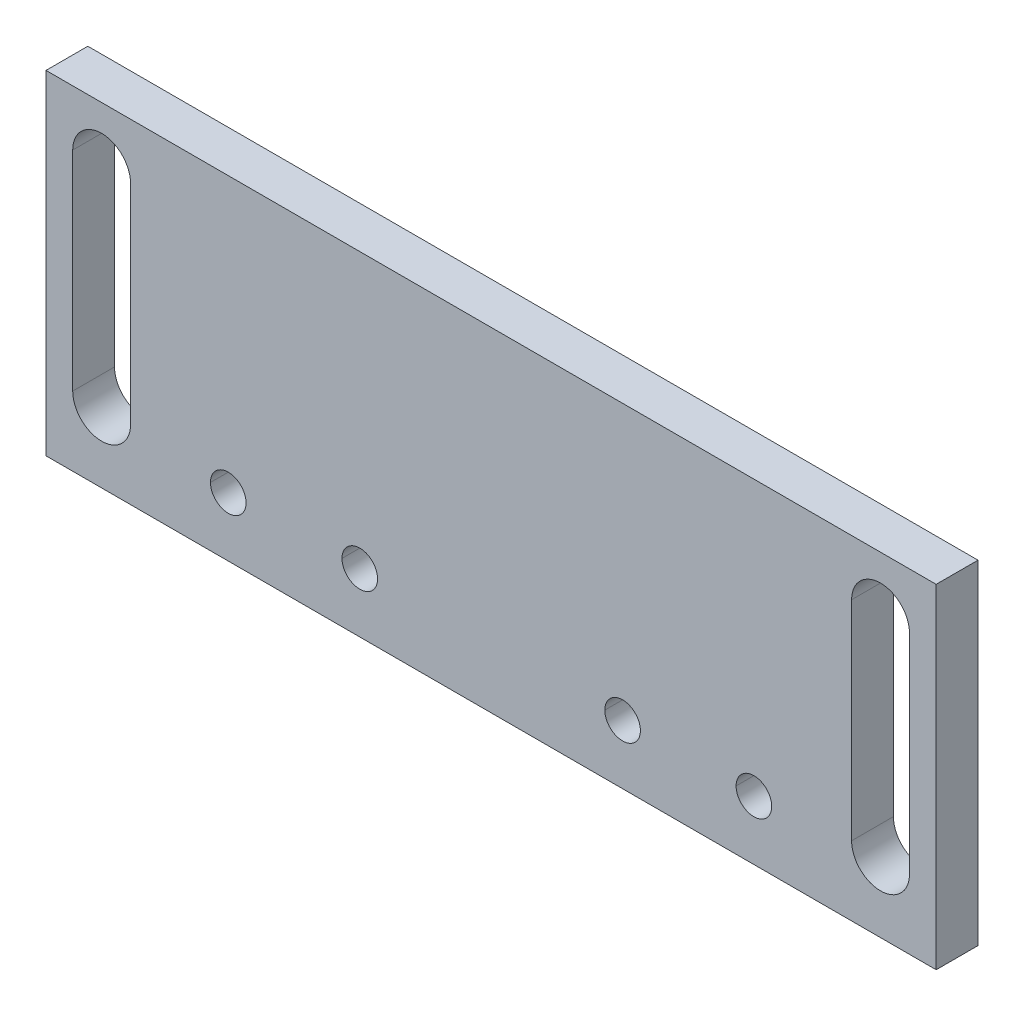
ISO-10303-21;
HEADER;
FILE_DESCRIPTION(('STEP AP214'),'2;1');
FILE_NAME('part.step','',(''),(''),'','','');
FILE_SCHEMA(('AUTOMOTIVE_DESIGN { 1 0 10303 214 1 1 1 1 }'));
ENDSEC;
DATA;
#1=APPLICATION_CONTEXT('core data for automotive mechanical design processes');
#2=APPLICATION_PROTOCOL_DEFINITION('international standard','automotive_design',2000,#1);
#3=PRODUCT_CONTEXT('',#1,'mechanical');
#4=PRODUCT('Part','Part','',(#3));
#5=PRODUCT_RELATED_PRODUCT_CATEGORY('part','',(#4));
#6=PRODUCT_DEFINITION_FORMATION('','',#4);
#7=PRODUCT_DEFINITION_CONTEXT('part definition',#1,'design');
#8=PRODUCT_DEFINITION('design','',#6,#7);
#9=PRODUCT_DEFINITION_SHAPE('','',#8);
#10=(LENGTH_UNIT() NAMED_UNIT(*) SI_UNIT(.MILLI.,.METRE.));
#11=(NAMED_UNIT(*) PLANE_ANGLE_UNIT() SI_UNIT($,.RADIAN.));
#12=(NAMED_UNIT(*) SI_UNIT($,.STERADIAN.) SOLID_ANGLE_UNIT());
#13=UNCERTAINTY_MEASURE_WITH_UNIT(LENGTH_MEASURE(1.E-05),#10,'distance_accuracy_value','');
#14=(GEOMETRIC_REPRESENTATION_CONTEXT(3) GLOBAL_UNCERTAINTY_ASSIGNED_CONTEXT((#13)) GLOBAL_UNIT_ASSIGNED_CONTEXT((#10,
#11,#12)) REPRESENTATION_CONTEXT('',''));
#15=CARTESIAN_POINT('',(0.,0.,0.));
#16=DIRECTION('',(0.,0.,1.));
#17=DIRECTION('',(1.,0.,0.));
#18=AXIS2_PLACEMENT_3D('',#15,#16,#17);
#19=CARTESIAN_POINT('',(69.85,66.5225999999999,4.7752));
#20=DIRECTION('',(0.,0.,-1.));
#21=DIRECTION('',(-1.,0.,0.));
#22=AXIS2_PLACEMENT_3D('',#19,#20,#21);
#23=PLANE('',#22);
#24=DIRECTION('',(1.,0.,0.));
#25=VECTOR('',#24,1.);
#26=CARTESIAN_POINT('',(-31.75,66.5225999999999,4.7752));
#27=LINE('',#26,#25);
#28=CARTESIAN_POINT('',(-31.75,66.5225999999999,4.7752));
#29=VERTEX_POINT('',#28);
#30=CARTESIAN_POINT('',(69.85,66.5225999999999,4.7752));
#31=VERTEX_POINT('',#30);
#32=EDGE_CURVE('E252',#29,#31,#27,.T.);
#33=ORIENTED_EDGE('',*,*,#32,.F.);
#34=DIRECTION('',(0.,1.,0.));
#35=VECTOR('',#34,1.);
#36=CARTESIAN_POINT('',(-31.75,28.4225999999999,4.7752));
#37=LINE('',#36,#35);
#38=CARTESIAN_POINT('',(-31.75,28.4225999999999,4.7752));
#39=VERTEX_POINT('',#38);
#40=EDGE_CURVE('E287',#39,#29,#37,.T.);
#41=ORIENTED_EDGE('',*,*,#40,.F.);
#42=DIRECTION('',(1.,0.,0.));
#43=VECTOR('',#42,1.);
#44=CARTESIAN_POINT('',(69.85,28.4225999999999,4.7752));
#45=LINE('',#44,#43);
#46=CARTESIAN_POINT('',(69.85,28.4225999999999,4.7752));
#47=VERTEX_POINT('',#46);
#48=EDGE_CURVE('E282',#47,#39,#45,.F.);
#49=ORIENTED_EDGE('',*,*,#48,.F.);
#50=DIRECTION('',(0.,1.,0.));
#51=VECTOR('',#50,1.);
#52=CARTESIAN_POINT('',(69.85,66.5225999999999,4.7752));
#53=LINE('',#52,#51);
#54=EDGE_CURVE('E276',#31,#47,#53,.F.);
#55=ORIENTED_EDGE('',*,*,#54,.F.);
#56=EDGE_LOOP('',(#33,#41,#49,#55));
#57=FACE_BOUND('',#56,.T.);
#58=DIRECTION('',(0.,1.,0.));
#59=VECTOR('',#58,1.);
#60=CARTESIAN_POINT('',(-28.702,36.3473999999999,4.7752));
#61=LINE('',#60,#59);
#62=CARTESIAN_POINT('',(-28.702,36.3473999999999,4.7752));
#63=VERTEX_POINT('',#62);
#64=CARTESIAN_POINT('',(-28.702,60.1725999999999,4.7752));
#65=VERTEX_POINT('',#64);
#66=EDGE_CURVE('E250',#63,#65,#61,.T.);
#67=ORIENTED_EDGE('',*,*,#66,.T.);
#68=CARTESIAN_POINT('',(-25.4,60.1725999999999,4.7752));
#69=DIRECTION('',(0.,0.,1.));
#70=DIRECTION('',(1.,0.,0.));
#71=AXIS2_PLACEMENT_3D('',#68,#69,#70);
#72=CIRCLE('',#71,3.302);
#73=CARTESIAN_POINT('',(-22.098,60.1725999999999,4.7752));
#74=VERTEX_POINT('',#73);
#75=EDGE_CURVE('E199',#65,#74,#72,.F.);
#76=ORIENTED_EDGE('',*,*,#75,.T.);
#77=DIRECTION('',(0.,1.,0.));
#78=VECTOR('',#77,1.);
#79=CARTESIAN_POINT('',(-22.098,60.1725999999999,4.7752));
#80=LINE('',#79,#78);
#81=CARTESIAN_POINT('',(-22.098,36.3473999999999,4.7752));
#82=VERTEX_POINT('',#81);
#83=EDGE_CURVE('E247',#74,#82,#80,.F.);
#84=ORIENTED_EDGE('',*,*,#83,.T.);
#85=CARTESIAN_POINT('',(-25.4,36.3473999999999,4.7752));
#86=DIRECTION('',(0.,0.,1.));
#87=DIRECTION('',(1.,0.,0.));
#88=AXIS2_PLACEMENT_3D('',#85,#86,#87);
#89=CIRCLE('',#88,3.302);
#90=EDGE_CURVE('E195',#82,#63,#89,.F.);
#91=ORIENTED_EDGE('',*,*,#90,.T.);
#92=EDGE_LOOP('',(#67,#76,#84,#91));
#93=FACE_BOUND('',#92,.T.);
#94=DIRECTION('',(0.,1.,0.));
#95=VECTOR('',#94,1.);
#96=CARTESIAN_POINT('',(66.802,60.1725999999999,4.7752));
#97=LINE('',#96,#95);
#98=CARTESIAN_POINT('',(66.802,60.1725999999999,4.7752));
#99=VERTEX_POINT('',#98);
#100=CARTESIAN_POINT('',(66.802,36.3473999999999,4.7752));
#101=VERTEX_POINT('',#100);
#102=EDGE_CURVE('E198',#99,#101,#97,.F.);
#103=ORIENTED_EDGE('',*,*,#102,.T.);
#104=CARTESIAN_POINT('',(63.5,36.3473999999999,4.7752));
#105=DIRECTION('',(0.,0.,1.));
#106=DIRECTION('',(1.,0.,0.));
#107=AXIS2_PLACEMENT_3D('',#104,#105,#106);
#108=CIRCLE('',#107,3.302);
#109=CARTESIAN_POINT('',(60.198,36.3473999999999,4.7752));
#110=VERTEX_POINT('',#109);
#111=EDGE_CURVE('E190',#101,#110,#108,.F.);
#112=ORIENTED_EDGE('',*,*,#111,.T.);
#113=DIRECTION('',(0.,1.,0.));
#114=VECTOR('',#113,1.);
#115=CARTESIAN_POINT('',(60.198,36.3473999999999,4.7752));
#116=LINE('',#115,#114);
#117=CARTESIAN_POINT('',(60.198,60.1725999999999,4.7752));
#118=VERTEX_POINT('',#117);
#119=EDGE_CURVE('E241',#110,#118,#116,.T.);
#120=ORIENTED_EDGE('',*,*,#119,.T.);
#121=CARTESIAN_POINT('',(63.5,60.1725999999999,4.7752));
#122=DIRECTION('',(0.,0.,1.));
#123=DIRECTION('',(1.,0.,0.));
#124=AXIS2_PLACEMENT_3D('',#121,#122,#123);
#125=CIRCLE('',#124,3.302);
#126=EDGE_CURVE('E186',#118,#99,#125,.F.);
#127=ORIENTED_EDGE('',*,*,#126,.T.);
#128=EDGE_LOOP('',(#103,#112,#120,#127));
#129=FACE_BOUND('',#128,.T.);
#130=CARTESIAN_POINT('',(4.06399999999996,35.1789999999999,4.7752));
#131=DIRECTION('',(0.,0.,1.));
#132=DIRECTION('',(1.,0.,0.));
#133=AXIS2_PLACEMENT_3D('',#130,#131,#132);
#134=CIRCLE('',#133,2.032);
#135=CARTESIAN_POINT('',(2.03199999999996,35.1789999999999,4.7752));
#136=VERTEX_POINT('',#135);
#137=CARTESIAN_POINT('',(6.09599999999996,35.1789999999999,4.7752));
#138=VERTEX_POINT('',#137);
#139=EDGE_CURVE('E180',#136,#138,#134,.F.);
#140=ORIENTED_EDGE('',*,*,#139,.T.);
#141=CARTESIAN_POINT('',(4.06399999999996,35.1789999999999,4.7752));
#142=DIRECTION('',(0.,0.,1.));
#143=DIRECTION('',(1.,0.,0.));
#144=AXIS2_PLACEMENT_3D('',#141,#142,#143);
#145=CIRCLE('',#144,2.032);
#146=EDGE_CURVE('E182',#138,#136,#145,.F.);
#147=ORIENTED_EDGE('',*,*,#146,.T.);
#148=EDGE_LOOP('',(#140,#147));
#149=FACE_BOUND('',#148,.T.);
#150=CARTESIAN_POINT('',(34.0614,35.1789999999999,4.7752));
#151=DIRECTION('',(0.,0.,1.));
#152=DIRECTION('',(1.,0.,0.));
#153=AXIS2_PLACEMENT_3D('',#150,#151,#152);
#154=CIRCLE('',#153,2.032);
#155=CARTESIAN_POINT('',(32.0294,35.1789999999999,4.7752));
#156=VERTEX_POINT('',#155);
#157=CARTESIAN_POINT('',(36.0934,35.1789999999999,4.7752));
#158=VERTEX_POINT('',#157);
#159=EDGE_CURVE('E174',#156,#158,#154,.F.);
#160=ORIENTED_EDGE('',*,*,#159,.T.);
#161=CARTESIAN_POINT('',(34.0614,35.1789999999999,4.7752));
#162=DIRECTION('',(0.,0.,1.));
#163=DIRECTION('',(1.,0.,0.));
#164=AXIS2_PLACEMENT_3D('',#161,#162,#163);
#165=CIRCLE('',#164,2.032);
#166=EDGE_CURVE('E176',#158,#156,#165,.F.);
#167=ORIENTED_EDGE('',*,*,#166,.T.);
#168=EDGE_LOOP('',(#160,#167));
#169=FACE_BOUND('',#168,.T.);
#170=CARTESIAN_POINT('',(-10.9474,35.1789999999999,4.7752));
#171=DIRECTION('',(0.,0.,1.));
#172=DIRECTION('',(1.,0.,0.));
#173=AXIS2_PLACEMENT_3D('',#170,#171,#172);
#174=CIRCLE('',#173,2.032);
#175=CARTESIAN_POINT('',(-12.9794,35.1789999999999,4.7752));
#176=VERTEX_POINT('',#175);
#177=CARTESIAN_POINT('',(-8.91540000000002,35.1789999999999,4.7752));
#178=VERTEX_POINT('',#177);
#179=EDGE_CURVE('E164',#176,#178,#174,.F.);
#180=ORIENTED_EDGE('',*,*,#179,.T.);
#181=CARTESIAN_POINT('',(-10.9474,35.1789999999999,4.7752));
#182=DIRECTION('',(0.,0.,1.));
#183=DIRECTION('',(1.,0.,0.));
#184=AXIS2_PLACEMENT_3D('',#181,#182,#183);
#185=CIRCLE('',#184,2.032);
#186=EDGE_CURVE('E171',#178,#176,#185,.F.);
#187=ORIENTED_EDGE('',*,*,#186,.T.);
#188=EDGE_LOOP('',(#180,#187));
#189=FACE_BOUND('',#188,.T.);
#190=CARTESIAN_POINT('',(49.0474,35.1789999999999,4.7752));
#191=DIRECTION('',(0.,0.,1.));
#192=DIRECTION('',(1.,0.,0.));
#193=AXIS2_PLACEMENT_3D('',#190,#191,#192);
#194=CIRCLE('',#193,2.032);
#195=CARTESIAN_POINT('',(47.0154,35.1789999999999,4.7752));
#196=VERTEX_POINT('',#195);
#197=CARTESIAN_POINT('',(51.0794,35.1789999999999,4.7752));
#198=VERTEX_POINT('',#197);
#199=EDGE_CURVE('E19',#196,#198,#194,.F.);
#200=ORIENTED_EDGE('',*,*,#199,.T.);
#201=CARTESIAN_POINT('',(49.0474,35.1789999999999,4.7752));
#202=DIRECTION('',(0.,0.,1.));
#203=DIRECTION('',(1.,0.,0.));
#204=AXIS2_PLACEMENT_3D('',#201,#202,#203);
#205=CIRCLE('',#204,2.032);
#206=EDGE_CURVE('E151',#198,#196,#205,.F.);
#207=ORIENTED_EDGE('',*,*,#206,.T.);
#208=EDGE_LOOP('',(#200,#207));
#209=FACE_BOUND('',#208,.T.);
#210=ADVANCED_FACE('F16',(#57,#93,#129,#149,#169,#189,#209),#23,.F.);
#211=CARTESIAN_POINT('',(49.0474,35.1789999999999,0.));
#212=DIRECTION('',(0.,0.,1.));
#213=DIRECTION('',(1.,0.,0.));
#214=AXIS2_PLACEMENT_3D('',#211,#212,#213);
#215=CYLINDRICAL_SURFACE('',#214,2.032);
#216=ORIENTED_EDGE('',*,*,#199,.F.);
#217=DIRECTION('',(0.,0.,1.));
#218=VECTOR('',#217,1.);
#219=CARTESIAN_POINT('',(47.0154,35.1789999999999,0.));
#220=LINE('',#219,#218);
#221=CARTESIAN_POINT('',(47.0154,35.1789999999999,0.));
#222=VERTEX_POINT('',#221);
#223=EDGE_CURVE('E165',#196,#222,#220,.F.);
#224=ORIENTED_EDGE('',*,*,#223,.T.);
#225=CARTESIAN_POINT('',(49.0474,35.1789999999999,0.));
#226=DIRECTION('',(0.,0.,1.));
#227=DIRECTION('',(1.,0.,0.));
#228=AXIS2_PLACEMENT_3D('',#225,#226,#227);
#229=CIRCLE('',#228,2.032);
#230=CARTESIAN_POINT('',(51.0794,35.1789999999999,0.));
#231=VERTEX_POINT('',#230);
#232=EDGE_CURVE('E160',#231,#222,#229,.T.);
#233=ORIENTED_EDGE('',*,*,#232,.F.);
#234=DIRECTION('',(0.,0.,1.));
#235=VECTOR('',#234,1.);
#236=CARTESIAN_POINT('',(51.0794,35.1789999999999,0.));
#237=LINE('',#236,#235);
#238=EDGE_CURVE('E157',#231,#198,#237,.T.);
#239=ORIENTED_EDGE('',*,*,#238,.T.);
#240=EDGE_LOOP('',(#216,#224,#233,#239));
#241=FACE_BOUND('',#240,.T.);
#242=ADVANCED_FACE('F158',(#241),#215,.F.);
#243=CARTESIAN_POINT('',(49.0474,35.1789999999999,0.));
#244=DIRECTION('',(0.,0.,1.));
#245=DIRECTION('',(1.,0.,0.));
#246=AXIS2_PLACEMENT_3D('',#243,#244,#245);
#247=CYLINDRICAL_SURFACE('',#246,2.032);
#248=CARTESIAN_POINT('',(49.0474,35.1789999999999,0.));
#249=DIRECTION('',(0.,0.,1.));
#250=DIRECTION('',(1.,0.,0.));
#251=AXIS2_PLACEMENT_3D('',#248,#249,#250);
#252=CIRCLE('',#251,2.032);
#253=EDGE_CURVE('E205',#222,#231,#252,.T.);
#254=ORIENTED_EDGE('',*,*,#253,.F.);
#255=ORIENTED_EDGE('',*,*,#223,.F.);
#256=ORIENTED_EDGE('',*,*,#206,.F.);
#257=ORIENTED_EDGE('',*,*,#238,.F.);
#258=EDGE_LOOP('',(#254,#255,#256,#257));
#259=FACE_BOUND('',#258,.T.);
#260=ADVANCED_FACE('F167',(#259),#247,.F.);
#261=CARTESIAN_POINT('',(-10.9474,35.1789999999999,0.));
#262=DIRECTION('',(0.,0.,1.));
#263=DIRECTION('',(1.,0.,0.));
#264=AXIS2_PLACEMENT_3D('',#261,#262,#263);
#265=CYLINDRICAL_SURFACE('',#264,2.032);
#266=ORIENTED_EDGE('',*,*,#179,.F.);
#267=DIRECTION('',(0.,0.,1.));
#268=VECTOR('',#267,1.);
#269=CARTESIAN_POINT('',(-12.9794,35.1789999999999,0.));
#270=LINE('',#269,#268);
#271=CARTESIAN_POINT('',(-12.9794,35.1789999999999,0.));
#272=VERTEX_POINT('',#271);
#273=EDGE_CURVE('E173',#176,#272,#270,.F.);
#274=ORIENTED_EDGE('',*,*,#273,.T.);
#275=CARTESIAN_POINT('',(-10.9474,35.1789999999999,0.));
#276=DIRECTION('',(0.,0.,1.));
#277=DIRECTION('',(1.,0.,0.));
#278=AXIS2_PLACEMENT_3D('',#275,#276,#277);
#279=CIRCLE('',#278,2.032);
#280=CARTESIAN_POINT('',(-8.91540000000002,35.1789999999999,0.));
#281=VERTEX_POINT('',#280);
#282=EDGE_CURVE('E207',#281,#272,#279,.T.);
#283=ORIENTED_EDGE('',*,*,#282,.F.);
#284=DIRECTION('',(0.,0.,1.));
#285=VECTOR('',#284,1.);
#286=CARTESIAN_POINT('',(-8.91540000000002,35.1789999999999,0.));
#287=LINE('',#286,#285);
#288=EDGE_CURVE('E177',#281,#178,#287,.T.);
#289=ORIENTED_EDGE('',*,*,#288,.T.);
#290=EDGE_LOOP('',(#266,#274,#283,#289));
#291=FACE_BOUND('',#290,.T.);
#292=ADVANCED_FACE('F388',(#291),#265,.F.);
#293=CARTESIAN_POINT('',(-10.9474,35.1789999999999,0.));
#294=DIRECTION('',(0.,0.,1.));
#295=DIRECTION('',(1.,0.,0.));
#296=AXIS2_PLACEMENT_3D('',#293,#294,#295);
#297=CYLINDRICAL_SURFACE('',#296,2.032);
#298=CARTESIAN_POINT('',(-10.9474,35.1789999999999,0.));
#299=DIRECTION('',(0.,0.,1.));
#300=DIRECTION('',(1.,0.,0.));
#301=AXIS2_PLACEMENT_3D('',#298,#299,#300);
#302=CIRCLE('',#301,2.032);
#303=EDGE_CURVE('E210',#272,#281,#302,.T.);
#304=ORIENTED_EDGE('',*,*,#303,.F.);
#305=ORIENTED_EDGE('',*,*,#273,.F.);
#306=ORIENTED_EDGE('',*,*,#186,.F.);
#307=ORIENTED_EDGE('',*,*,#288,.F.);
#308=EDGE_LOOP('',(#304,#305,#306,#307));
#309=FACE_BOUND('',#308,.T.);
#310=ADVANCED_FACE('F384',(#309),#297,.F.);
#311=CARTESIAN_POINT('',(34.0614,35.1789999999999,0.));
#312=DIRECTION('',(0.,0.,1.));
#313=DIRECTION('',(1.,0.,0.));
#314=AXIS2_PLACEMENT_3D('',#311,#312,#313);
#315=CYLINDRICAL_SURFACE('',#314,2.032);
#316=ORIENTED_EDGE('',*,*,#159,.F.);
#317=DIRECTION('',(0.,0.,1.));
#318=VECTOR('',#317,1.);
#319=CARTESIAN_POINT('',(32.0294,35.1789999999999,0.));
#320=LINE('',#319,#318);
#321=CARTESIAN_POINT('',(32.0294,35.1789999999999,0.));
#322=VERTEX_POINT('',#321);
#323=EDGE_CURVE('E179',#156,#322,#320,.F.);
#324=ORIENTED_EDGE('',*,*,#323,.T.);
#325=CARTESIAN_POINT('',(34.0614,35.1789999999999,0.));
#326=DIRECTION('',(0.,0.,1.));
#327=DIRECTION('',(1.,0.,0.));
#328=AXIS2_PLACEMENT_3D('',#325,#326,#327);
#329=CIRCLE('',#328,2.032);
#330=CARTESIAN_POINT('',(36.0934,35.1789999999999,0.));
#331=VERTEX_POINT('',#330);
#332=EDGE_CURVE('E213',#331,#322,#329,.T.);
#333=ORIENTED_EDGE('',*,*,#332,.F.);
#334=DIRECTION('',(0.,0.,1.));
#335=VECTOR('',#334,1.);
#336=CARTESIAN_POINT('',(36.0934,35.1789999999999,0.));
#337=LINE('',#336,#335);
#338=EDGE_CURVE('E183',#331,#158,#337,.T.);
#339=ORIENTED_EDGE('',*,*,#338,.T.);
#340=EDGE_LOOP('',(#316,#324,#333,#339));
#341=FACE_BOUND('',#340,.T.);
#342=ADVANCED_FACE('F380',(#341),#315,.F.);
#343=CARTESIAN_POINT('',(34.0614,35.1789999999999,0.));
#344=DIRECTION('',(0.,0.,1.));
#345=DIRECTION('',(1.,0.,0.));
#346=AXIS2_PLACEMENT_3D('',#343,#344,#345);
#347=CYLINDRICAL_SURFACE('',#346,2.032);
#348=CARTESIAN_POINT('',(34.0614,35.1789999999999,0.));
#349=DIRECTION('',(0.,0.,1.));
#350=DIRECTION('',(1.,0.,0.));
#351=AXIS2_PLACEMENT_3D('',#348,#349,#350);
#352=CIRCLE('',#351,2.032);
#353=EDGE_CURVE('E216',#322,#331,#352,.T.);
#354=ORIENTED_EDGE('',*,*,#353,.F.);
#355=ORIENTED_EDGE('',*,*,#323,.F.);
#356=ORIENTED_EDGE('',*,*,#166,.F.);
#357=ORIENTED_EDGE('',*,*,#338,.F.);
#358=EDGE_LOOP('',(#354,#355,#356,#357));
#359=FACE_BOUND('',#358,.T.);
#360=ADVANCED_FACE('F376',(#359),#347,.F.);
#361=CARTESIAN_POINT('',(4.06399999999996,35.1789999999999,0.));
#362=DIRECTION('',(0.,0.,1.));
#363=DIRECTION('',(1.,0.,0.));
#364=AXIS2_PLACEMENT_3D('',#361,#362,#363);
#365=CYLINDRICAL_SURFACE('',#364,2.032);
#366=ORIENTED_EDGE('',*,*,#139,.F.);
#367=DIRECTION('',(0.,0.,1.));
#368=VECTOR('',#367,1.);
#369=CARTESIAN_POINT('',(2.03199999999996,35.1789999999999,0.));
#370=LINE('',#369,#368);
#371=CARTESIAN_POINT('',(2.03199999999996,35.1789999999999,0.));
#372=VERTEX_POINT('',#371);
#373=EDGE_CURVE('E185',#136,#372,#370,.F.);
#374=ORIENTED_EDGE('',*,*,#373,.T.);
#375=CARTESIAN_POINT('',(4.06399999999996,35.1789999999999,0.));
#376=DIRECTION('',(0.,0.,1.));
#377=DIRECTION('',(1.,0.,0.));
#378=AXIS2_PLACEMENT_3D('',#375,#376,#377);
#379=CIRCLE('',#378,2.032);
#380=CARTESIAN_POINT('',(6.09599999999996,35.1789999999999,0.));
#381=VERTEX_POINT('',#380);
#382=EDGE_CURVE('E219',#381,#372,#379,.T.);
#383=ORIENTED_EDGE('',*,*,#382,.F.);
#384=DIRECTION('',(0.,0.,1.));
#385=VECTOR('',#384,1.);
#386=CARTESIAN_POINT('',(6.09599999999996,35.1789999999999,0.));
#387=LINE('',#386,#385);
#388=EDGE_CURVE('E189',#381,#138,#387,.T.);
#389=ORIENTED_EDGE('',*,*,#388,.T.);
#390=EDGE_LOOP('',(#366,#374,#383,#389));
#391=FACE_BOUND('',#390,.T.);
#392=ADVANCED_FACE('F372',(#391),#365,.F.);
#393=CARTESIAN_POINT('',(4.06399999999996,35.1789999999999,0.));
#394=DIRECTION('',(0.,0.,1.));
#395=DIRECTION('',(1.,0.,0.));
#396=AXIS2_PLACEMENT_3D('',#393,#394,#395);
#397=CYLINDRICAL_SURFACE('',#396,2.032);
#398=CARTESIAN_POINT('',(4.06399999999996,35.1789999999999,0.));
#399=DIRECTION('',(0.,0.,1.));
#400=DIRECTION('',(1.,0.,0.));
#401=AXIS2_PLACEMENT_3D('',#398,#399,#400);
#402=CIRCLE('',#401,2.032);
#403=EDGE_CURVE('E222',#372,#381,#402,.T.);
#404=ORIENTED_EDGE('',*,*,#403,.F.);
#405=ORIENTED_EDGE('',*,*,#373,.F.);
#406=ORIENTED_EDGE('',*,*,#146,.F.);
#407=ORIENTED_EDGE('',*,*,#388,.F.);
#408=EDGE_LOOP('',(#404,#405,#406,#407));
#409=FACE_BOUND('',#408,.T.);
#410=ADVANCED_FACE('F368',(#409),#397,.F.);
#411=CARTESIAN_POINT('',(63.5,60.1725999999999,0.));
#412=DIRECTION('',(0.,0.,1.));
#413=DIRECTION('',(1.,0.,0.));
#414=AXIS2_PLACEMENT_3D('',#411,#412,#413);
#415=CYLINDRICAL_SURFACE('',#414,3.302);
#416=DIRECTION('',(0.,0.,1.));
#417=VECTOR('',#416,1.);
#418=CARTESIAN_POINT('',(60.198,60.1725999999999,0.));
#419=LINE('',#418,#417);
#420=CARTESIAN_POINT('',(60.198,60.1725999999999,0.));
#421=VERTEX_POINT('',#420);
#422=EDGE_CURVE('E188',#118,#421,#419,.F.);
#423=ORIENTED_EDGE('',*,*,#422,.T.);
#424=CARTESIAN_POINT('',(63.5,60.1725999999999,0.));
#425=DIRECTION('',(0.,0.,1.));
#426=DIRECTION('',(1.,0.,0.));
#427=AXIS2_PLACEMENT_3D('',#424,#425,#426);
#428=CIRCLE('',#427,3.302);
#429=CARTESIAN_POINT('',(66.802,60.1725999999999,0.));
#430=VERTEX_POINT('',#429);
#431=EDGE_CURVE('E225',#430,#421,#428,.T.);
#432=ORIENTED_EDGE('',*,*,#431,.F.);
#433=DIRECTION('',(0.,0.,-1.));
#434=VECTOR('',#433,1.);
#435=CARTESIAN_POINT('',(66.802,60.1725999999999,0.));
#436=LINE('',#435,#434);
#437=EDGE_CURVE('E246',#430,#99,#436,.F.);
#438=ORIENTED_EDGE('',*,*,#437,.T.);
#439=ORIENTED_EDGE('',*,*,#126,.F.);
#440=EDGE_LOOP('',(#423,#432,#438,#439));
#441=FACE_BOUND('',#440,.T.);
#442=ADVANCED_FACE('F364',(#441),#415,.F.);
#443=CARTESIAN_POINT('',(60.198,36.3473999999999,0.));
#444=DIRECTION('',(-1.,0.,0.));
#445=DIRECTION('',(0.,0.,1.));
#446=AXIS2_PLACEMENT_3D('',#443,#444,#445);
#447=PLANE('',#446);
#448=DIRECTION('',(0.,0.,1.));
#449=VECTOR('',#448,1.);
#450=CARTESIAN_POINT('',(60.198,36.3473999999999,0.));
#451=LINE('',#450,#449);
#452=CARTESIAN_POINT('',(60.198,36.3473999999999,0.));
#453=VERTEX_POINT('',#452);
#454=EDGE_CURVE('E194',#110,#453,#451,.F.);
#455=ORIENTED_EDGE('',*,*,#454,.T.);
#456=DIRECTION('',(0.,1.,0.));
#457=VECTOR('',#456,1.);
#458=CARTESIAN_POINT('',(60.198,47.4725999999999,0.));
#459=LINE('',#458,#457);
#460=EDGE_CURVE('E228',#421,#453,#459,.F.);
#461=ORIENTED_EDGE('',*,*,#460,.F.);
#462=ORIENTED_EDGE('',*,*,#422,.F.);
#463=ORIENTED_EDGE('',*,*,#119,.F.);
#464=EDGE_LOOP('',(#455,#461,#462,#463));
#465=FACE_BOUND('',#464,.T.);
#466=ADVANCED_FACE('F360',(#465),#447,.F.);
#467=CARTESIAN_POINT('',(63.5,36.3473999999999,0.));
#468=DIRECTION('',(0.,0.,1.));
#469=DIRECTION('',(1.,0.,0.));
#470=AXIS2_PLACEMENT_3D('',#467,#468,#469);
#471=CYLINDRICAL_SURFACE('',#470,3.302);
#472=DIRECTION('',(0.,0.,-1.));
#473=VECTOR('',#472,1.);
#474=CARTESIAN_POINT('',(66.802,36.3473999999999,0.));
#475=LINE('',#474,#473);
#476=CARTESIAN_POINT('',(66.802,36.3473999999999,0.));
#477=VERTEX_POINT('',#476);
#478=EDGE_CURVE('E193',#101,#477,#475,.T.);
#479=ORIENTED_EDGE('',*,*,#478,.T.);
#480=CARTESIAN_POINT('',(63.5,36.3473999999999,0.));
#481=DIRECTION('',(0.,0.,1.));
#482=DIRECTION('',(1.,0.,0.));
#483=AXIS2_PLACEMENT_3D('',#480,#481,#482);
#484=CIRCLE('',#483,3.302);
#485=EDGE_CURVE('E229',#453,#477,#484,.T.);
#486=ORIENTED_EDGE('',*,*,#485,.F.);
#487=ORIENTED_EDGE('',*,*,#454,.F.);
#488=ORIENTED_EDGE('',*,*,#111,.F.);
#489=EDGE_LOOP('',(#479,#486,#487,#488));
#490=FACE_BOUND('',#489,.T.);
#491=ADVANCED_FACE('F356',(#490),#471,.F.);
#492=CARTESIAN_POINT('',(66.802,60.1725999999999,0.));
#493=DIRECTION('',(1.,0.,0.));
#494=DIRECTION('',(0.,0.,-1.));
#495=AXIS2_PLACEMENT_3D('',#492,#493,#494);
#496=PLANE('',#495);
#497=ORIENTED_EDGE('',*,*,#437,.F.);
#498=DIRECTION('',(0.,1.,0.));
#499=VECTOR('',#498,1.);
#500=CARTESIAN_POINT('',(66.802,47.4725999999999,0.));
#501=LINE('',#500,#499);
#502=EDGE_CURVE('E232',#477,#430,#501,.T.);
#503=ORIENTED_EDGE('',*,*,#502,.F.);
#504=ORIENTED_EDGE('',*,*,#478,.F.);
#505=ORIENTED_EDGE('',*,*,#102,.F.);
#506=EDGE_LOOP('',(#497,#503,#504,#505));
#507=FACE_BOUND('',#506,.T.);
#508=ADVANCED_FACE('F352',(#507),#496,.F.);
#509=CARTESIAN_POINT('',(-25.4,36.3473999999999,0.));
#510=DIRECTION('',(0.,0.,1.));
#511=DIRECTION('',(1.,0.,0.));
#512=AXIS2_PLACEMENT_3D('',#509,#510,#511);
#513=CYLINDRICAL_SURFACE('',#512,3.302);
#514=DIRECTION('',(0.,0.,-1.));
#515=VECTOR('',#514,1.);
#516=CARTESIAN_POINT('',(-22.098,36.3473999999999,0.));
#517=LINE('',#516,#515);
#518=CARTESIAN_POINT('',(-22.098,36.3473999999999,0.));
#519=VERTEX_POINT('',#518);
#520=EDGE_CURVE('E197',#82,#519,#517,.T.);
#521=ORIENTED_EDGE('',*,*,#520,.T.);
#522=CARTESIAN_POINT('',(-25.4,36.3473999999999,0.));
#523=DIRECTION('',(0.,0.,1.));
#524=DIRECTION('',(1.,0.,0.));
#525=AXIS2_PLACEMENT_3D('',#522,#523,#524);
#526=CIRCLE('',#525,3.302);
#527=CARTESIAN_POINT('',(-28.702,36.3473999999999,0.));
#528=VERTEX_POINT('',#527);
#529=EDGE_CURVE('E233',#528,#519,#526,.T.);
#530=ORIENTED_EDGE('',*,*,#529,.F.);
#531=DIRECTION('',(0.,0.,1.));
#532=VECTOR('',#531,1.);
#533=CARTESIAN_POINT('',(-28.702,36.3473999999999,0.));
#534=LINE('',#533,#532);
#535=EDGE_CURVE('E253',#528,#63,#534,.T.);
#536=ORIENTED_EDGE('',*,*,#535,.T.);
#537=ORIENTED_EDGE('',*,*,#90,.F.);
#538=EDGE_LOOP('',(#521,#530,#536,#537));
#539=FACE_BOUND('',#538,.T.);
#540=ADVANCED_FACE('F348',(#539),#513,.F.);
#541=CARTESIAN_POINT('',(-22.098,60.1725999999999,0.));
#542=DIRECTION('',(1.,0.,0.));
#543=DIRECTION('',(0.,0.,-1.));
#544=AXIS2_PLACEMENT_3D('',#541,#542,#543);
#545=PLANE('',#544);
#546=DIRECTION('',(0.,0.,1.));
#547=VECTOR('',#546,1.);
#548=CARTESIAN_POINT('',(-22.098,60.1725999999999,0.));
#549=LINE('',#548,#547);
#550=CARTESIAN_POINT('',(-22.098,60.1725999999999,0.));
#551=VERTEX_POINT('',#550);
#552=EDGE_CURVE('E203',#74,#551,#549,.F.);
#553=ORIENTED_EDGE('',*,*,#552,.T.);
#554=DIRECTION('',(0.,1.,0.));
#555=VECTOR('',#554,1.);
#556=CARTESIAN_POINT('',(-22.098,47.4725999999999,0.));
#557=LINE('',#556,#555);
#558=EDGE_CURVE('E236',#519,#551,#557,.T.);
#559=ORIENTED_EDGE('',*,*,#558,.F.);
#560=ORIENTED_EDGE('',*,*,#520,.F.);
#561=ORIENTED_EDGE('',*,*,#83,.F.);
#562=EDGE_LOOP('',(#553,#559,#560,#561));
#563=FACE_BOUND('',#562,.T.);
#564=ADVANCED_FACE('F344',(#563),#545,.F.);
#565=CARTESIAN_POINT('',(-25.4,60.1725999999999,0.));
#566=DIRECTION('',(0.,0.,1.));
#567=DIRECTION('',(1.,0.,0.));
#568=AXIS2_PLACEMENT_3D('',#565,#566,#567);
#569=CYLINDRICAL_SURFACE('',#568,3.302);
#570=DIRECTION('',(0.,0.,1.));
#571=VECTOR('',#570,1.);
#572=CARTESIAN_POINT('',(-28.702,60.1725999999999,0.));
#573=LINE('',#572,#571);
#574=CARTESIAN_POINT('',(-28.702,60.1725999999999,0.));
#575=VERTEX_POINT('',#574);
#576=EDGE_CURVE('E202',#65,#575,#573,.F.);
#577=ORIENTED_EDGE('',*,*,#576,.T.);
#578=CARTESIAN_POINT('',(-25.4,60.1725999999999,0.));
#579=DIRECTION('',(0.,0.,1.));
#580=DIRECTION('',(1.,0.,0.));
#581=AXIS2_PLACEMENT_3D('',#578,#579,#580);
#582=CIRCLE('',#581,3.302);
#583=EDGE_CURVE('E237',#551,#575,#582,.T.);
#584=ORIENTED_EDGE('',*,*,#583,.F.);
#585=ORIENTED_EDGE('',*,*,#552,.F.);
#586=ORIENTED_EDGE('',*,*,#75,.F.);
#587=EDGE_LOOP('',(#577,#584,#585,#586));
#588=FACE_BOUND('',#587,.T.);
#589=ADVANCED_FACE('F340',(#588),#569,.F.);
#590=CARTESIAN_POINT('',(-28.702,36.3473999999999,0.));
#591=DIRECTION('',(-1.,0.,0.));
#592=DIRECTION('',(0.,0.,1.));
#593=AXIS2_PLACEMENT_3D('',#590,#591,#592);
#594=PLANE('',#593);
#595=ORIENTED_EDGE('',*,*,#535,.F.);
#596=DIRECTION('',(0.,1.,0.));
#597=VECTOR('',#596,1.);
#598=CARTESIAN_POINT('',(-28.702,47.4725999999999,0.));
#599=LINE('',#598,#597);
#600=EDGE_CURVE('E240',#575,#528,#599,.F.);
#601=ORIENTED_EDGE('',*,*,#600,.F.);
#602=ORIENTED_EDGE('',*,*,#576,.F.);
#603=ORIENTED_EDGE('',*,*,#66,.F.);
#604=EDGE_LOOP('',(#595,#601,#602,#603));
#605=FACE_BOUND('',#604,.T.);
#606=ADVANCED_FACE('F337',(#605),#594,.F.);
#607=CARTESIAN_POINT('',(-31.75,66.5225999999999,0.));
#608=DIRECTION('',(0.,1.,0.));
#609=DIRECTION('',(0.,0.,1.));
#610=AXIS2_PLACEMENT_3D('',#607,#608,#609);
#611=PLANE('',#610);
#612=DIRECTION('',(-1.,0.,0.));
#613=VECTOR('',#612,1.);
#614=CARTESIAN_POINT('',(19.05,66.5225999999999,0.));
#615=LINE('',#614,#613);
#616=CARTESIAN_POINT('',(-31.75,66.5225999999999,0.));
#617=VERTEX_POINT('',#616);
#618=CARTESIAN_POINT('',(69.85,66.5225999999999,0.));
#619=VERTEX_POINT('',#618);
#620=EDGE_CURVE('E302',#617,#619,#615,.F.);
#621=ORIENTED_EDGE('',*,*,#620,.F.);
#622=DIRECTION('',(0.,0.,1.));
#623=VECTOR('',#622,1.);
#624=CARTESIAN_POINT('',(-31.75,66.5225999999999,0.));
#625=LINE('',#624,#623);
#626=EDGE_CURVE('E290',#29,#617,#625,.F.);
#627=ORIENTED_EDGE('',*,*,#626,.F.);
#628=ORIENTED_EDGE('',*,*,#32,.T.);
#629=DIRECTION('',(0.,0.,-1.));
#630=VECTOR('',#629,1.);
#631=CARTESIAN_POINT('',(69.85,66.5225999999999,0.));
#632=LINE('',#631,#630);
#633=EDGE_CURVE('E279',#619,#31,#632,.F.);
#634=ORIENTED_EDGE('',*,*,#633,.F.);
#635=EDGE_LOOP('',(#621,#627,#628,#634));
#636=FACE_BOUND('',#635,.T.);
#637=ADVANCED_FACE('F320',(#636),#611,.T.);
#638=CARTESIAN_POINT('',(69.85,66.5225999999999,0.));
#639=DIRECTION('',(1.,0.,0.));
#640=DIRECTION('',(0.,0.,-1.));
#641=AXIS2_PLACEMENT_3D('',#638,#639,#640);
#642=PLANE('',#641);
#643=DIRECTION('',(0.,1.,0.));
#644=VECTOR('',#643,1.);
#645=CARTESIAN_POINT('',(69.85,47.4725999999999,0.));
#646=LINE('',#645,#644);
#647=CARTESIAN_POINT('',(69.85,28.4225999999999,0.));
#648=VERTEX_POINT('',#647);
#649=EDGE_CURVE('E305',#619,#648,#646,.F.);
#650=ORIENTED_EDGE('',*,*,#649,.F.);
#651=ORIENTED_EDGE('',*,*,#633,.T.);
#652=ORIENTED_EDGE('',*,*,#54,.T.);
#653=DIRECTION('',(0.,0.,-1.));
#654=VECTOR('',#653,1.);
#655=CARTESIAN_POINT('',(69.85,28.4225999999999,0.));
#656=LINE('',#655,#654);
#657=EDGE_CURVE('E284',#648,#47,#656,.F.);
#658=ORIENTED_EDGE('',*,*,#657,.F.);
#659=EDGE_LOOP('',(#650,#651,#652,#658));
#660=FACE_BOUND('',#659,.T.);
#661=ADVANCED_FACE('F315',(#660),#642,.T.);
#662=CARTESIAN_POINT('',(69.85,28.4225999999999,0.));
#663=DIRECTION('',(0.,-1.,0.));
#664=DIRECTION('',(0.,0.,-1.));
#665=AXIS2_PLACEMENT_3D('',#662,#663,#664);
#666=PLANE('',#665);
#667=DIRECTION('',(-1.,0.,0.));
#668=VECTOR('',#667,1.);
#669=CARTESIAN_POINT('',(19.05,28.4225999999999,0.));
#670=LINE('',#669,#668);
#671=CARTESIAN_POINT('',(-31.75,28.4225999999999,0.));
#672=VERTEX_POINT('',#671);
#673=EDGE_CURVE('E25',#648,#672,#670,.T.);
#674=ORIENTED_EDGE('',*,*,#673,.F.);
#675=ORIENTED_EDGE('',*,*,#657,.T.);
#676=ORIENTED_EDGE('',*,*,#48,.T.);
#677=DIRECTION('',(0.,0.,1.));
#678=VECTOR('',#677,1.);
#679=CARTESIAN_POINT('',(-31.75,28.4225999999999,0.));
#680=LINE('',#679,#678);
#681=EDGE_CURVE('E34',#672,#39,#680,.T.);
#682=ORIENTED_EDGE('',*,*,#681,.F.);
#683=EDGE_LOOP('',(#674,#675,#676,#682));
#684=FACE_BOUND('',#683,.T.);
#685=ADVANCED_FACE('F313',(#684),#666,.T.);
#686=CARTESIAN_POINT('',(-31.75,28.4225999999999,0.));
#687=DIRECTION('',(-1.,0.,0.));
#688=DIRECTION('',(0.,0.,1.));
#689=AXIS2_PLACEMENT_3D('',#686,#687,#688);
#690=PLANE('',#689);
#691=DIRECTION('',(0.,1.,0.));
#692=VECTOR('',#691,1.);
#693=CARTESIAN_POINT('',(-31.75,47.4725999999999,0.));
#694=LINE('',#693,#692);
#695=EDGE_CURVE('E10',#672,#617,#694,.T.);
#696=ORIENTED_EDGE('',*,*,#695,.F.);
#697=ORIENTED_EDGE('',*,*,#681,.T.);
#698=ORIENTED_EDGE('',*,*,#40,.T.);
#699=ORIENTED_EDGE('',*,*,#626,.T.);
#700=EDGE_LOOP('',(#696,#697,#698,#699));
#701=FACE_BOUND('',#700,.T.);
#702=ADVANCED_FACE('F322',(#701),#690,.T.);
#703=CARTESIAN_POINT('',(19.05,47.4725999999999,0.));
#704=DIRECTION('',(0.,0.,-1.));
#705=DIRECTION('',(-1.,0.,0.));
#706=AXIS2_PLACEMENT_3D('',#703,#704,#705);
#707=PLANE('',#706);
#708=ORIENTED_EDGE('',*,*,#673,.T.);
#709=ORIENTED_EDGE('',*,*,#695,.T.);
#710=ORIENTED_EDGE('',*,*,#620,.T.);
#711=ORIENTED_EDGE('',*,*,#649,.T.);
#712=EDGE_LOOP('',(#708,#709,#710,#711));
#713=FACE_BOUND('',#712,.T.);
#714=ORIENTED_EDGE('',*,*,#583,.T.);
#715=ORIENTED_EDGE('',*,*,#600,.T.);
#716=ORIENTED_EDGE('',*,*,#529,.T.);
#717=ORIENTED_EDGE('',*,*,#558,.T.);
#718=EDGE_LOOP('',(#714,#715,#716,#717));
#719=FACE_BOUND('',#718,.T.);
#720=ORIENTED_EDGE('',*,*,#485,.T.);
#721=ORIENTED_EDGE('',*,*,#502,.T.);
#722=ORIENTED_EDGE('',*,*,#431,.T.);
#723=ORIENTED_EDGE('',*,*,#460,.T.);
#724=EDGE_LOOP('',(#720,#721,#722,#723));
#725=FACE_BOUND('',#724,.T.);
#726=ORIENTED_EDGE('',*,*,#382,.T.);
#727=ORIENTED_EDGE('',*,*,#403,.T.);
#728=EDGE_LOOP('',(#726,#727));
#729=FACE_BOUND('',#728,.T.);
#730=ORIENTED_EDGE('',*,*,#332,.T.);
#731=ORIENTED_EDGE('',*,*,#353,.T.);
#732=EDGE_LOOP('',(#730,#731));
#733=FACE_BOUND('',#732,.T.);
#734=ORIENTED_EDGE('',*,*,#282,.T.);
#735=ORIENTED_EDGE('',*,*,#303,.T.);
#736=EDGE_LOOP('',(#734,#735));
#737=FACE_BOUND('',#736,.T.);
#738=ORIENTED_EDGE('',*,*,#232,.T.);
#739=ORIENTED_EDGE('',*,*,#253,.T.);
#740=EDGE_LOOP('',(#738,#739));
#741=FACE_BOUND('',#740,.T.);
#742=ADVANCED_FACE('F310',(#713,#719,#725,#729,#733,#737,#741),#707,.T.);
#743=CLOSED_SHELL('',(#210,#242,#260,#292,#310,#342,#360,#392,#410,#442,#466,#491,#508,#540,
#564,#589,#606,#637,#661,#685,#702,#742));
#744=MANIFOLD_SOLID_BREP('B1',#743);
#745=ADVANCED_BREP_SHAPE_REPRESENTATION('',(#18,#744),#14);
#746=SHAPE_DEFINITION_REPRESENTATION(#9,#745);
ENDSEC;
END-ISO-10303-21;
